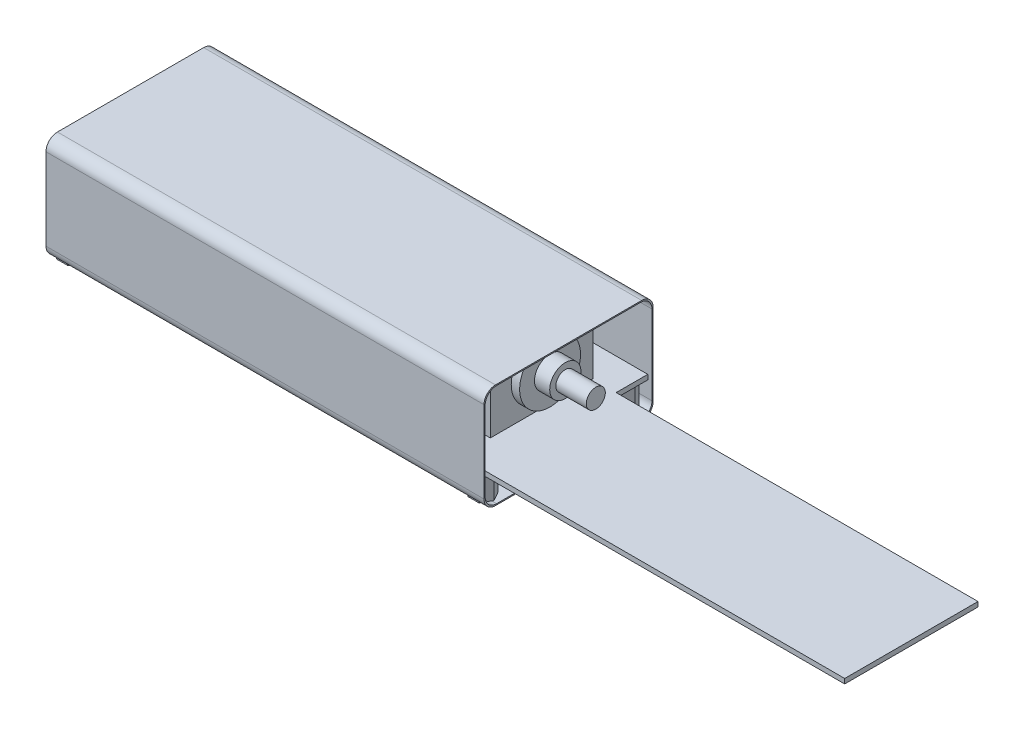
from build123d import *

# Parameters (mm, degrees)
SKETCH1_W            = 145.034
SKETCH1_H            = 54.991
BASE_EXTRUDE_DEPTH   = 1.6002
SKETCH2_W            = 87.884
SKETCH2_H            = 54.991
BOSS_EXTRUDE1_DEPTH  = 12.7
CONN_COMM_DEPTH      = 2.54
CONN_COMM_DEPTH_BACK = 6.35
SKETCH16_W           = 20.32
SKETCH16_H           = 9.144
SKETCH17_W           = 5.08
SKETCH17_H           = 10.16
CONN_PINS_DEPTH      = 16.51
SKETCH17_W_2         = 7.62
SKETCH17_H_2         = 2.54
CONN_PINS_2_DEPTH    = 16.51
SKETCH14_W           = 20.052826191
SKETCH14_H           = 12.7
COILS_DEPTH          = 9.525
SKETCH3_W            = 12.446
SKETCH3_H            = 34.29
BOSS_EXTRUDE2_DEPTH  = 22.606
SKETCH6_R            = 1.27
HEXSTNDOFF_DEPTH     = 9.525
SHIELD_DEPTH         = 146.05
CUT_EXTRUDE1_START   = -6.35
SKETCH18_R           = 1.27
CUT_EXTRUDE1_DEPTH   = 6.35
SKETCH19_W           = 44.45
SKETCH19_H           = 1.6002
EXTRUDE1_DEPTH       = 120.65


with BuildPart() as part:
    # Sketch1 → Base-Extrude (new body)
    with BuildSketch(Plane(origin=(0, 0, 0), x_dir=(1, 0, 0), z_dir=(0, 1, 0))):
        with Locations((72.517, 27.4955)):
            Rectangle(SKETCH1_W, SKETCH1_H)
    extrude(amount=BASE_EXTRUDE_DEPTH)

    # Sketch2 → Boss-Extrude1 (add)
    with BuildSketch(Plane(origin=(0, 1.6002, 0), x_dir=(-1, 0, 0), z_dir=(0, 1, 0))):
        with Locations((-43.942, -27.4955)):
            Rectangle(SKETCH2_W, SKETCH2_H)
    extrude(amount=BOSS_EXTRUDE1_DEPTH)

    # Sketch16 → Conn Comm (add, two sides: drawn at the far end of the back side and taken through both)
    with BuildSketch(Plane.ZY.offset(-CONN_COMM_DEPTH_BACK)):
        with Locations((-27.4955, 13.462)):
            Rectangle(SKETCH16_W, SKETCH16_H)
    extrude(amount=CONN_COMM_DEPTH + CONN_COMM_DEPTH_BACK)

    # Sketch14 → Coils (add)
    with BuildSketch(Plane.XZ):
        with Locations((67.762988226, -14.403423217)):
            Rectangle(SKETCH14_W, SKETCH14_H)
        with Locations((67.762988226, -38.458362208)):
            Rectangle(SKETCH14_W, SKETCH14_H)
    extrude(amount=COILS_DEPTH)

    # Sketch3 → Boss-Extrude2 (add)
    with BuildSketch(Plane(origin=(0, 1.6002, 0), x_dir=(-1, 0, 0), z_dir=(0, 1, 0))):
        with Locations((-130.937, -27.4955)):
            Rectangle(SKETCH3_W, SKETCH3_H)
    extrude(amount=BOSS_EXTRUDE2_DEPTH)

    # Sketch4 → Boss-Revolve1 (revolve)
    with BuildSketch(Plane(origin=(0, 13.5382, 0), x_dir=(-1, 0, 0), z_dir=(0, 1, 0)), mode=Mode.PRIVATE) as boss_revolve1_sk:
        Polygon((-155.194, -27.4955), (-155.194, -30.6705), (-145.034, -30.6705), (-145.034, -32.7025), (-139.954, -32.7025), (-139.954, -37.6555), (-137.16, -37.6555), (-137.16, -27.4955), align=None)
    revolve(boss_revolve1_sk.sketch.rotate(Axis((137.16, 13.5382, -27.4955), (1, 0, 0)), 180), axis=Axis((137.16, 13.5382, -27.4955), (1, 0, 0)))

    # Sketch5 → Boss-Revolve2 (revolve)
    with BuildSketch(Plane(origin=(0, 13.5382, 0), x_dir=(-1, 0, 0), z_dir=(0, 1, 0))):
        Polygon((-124.714, -27.4955), (-124.714, -36.3855), (-122.936, -36.3855), (-122.936, -38.6715), (-105.918, -38.6715), (-105.918, -31.9405), (-96.393, -31.9405), (-96.393, -27.4955), align=None)
    revolve(axis=Axis((124.714, 13.5382, -27.4955), (-1, 0, 0)))

    # Sketch6 → HexStndOff (add)
    # profile 1 of 4: a face of its own
    with BuildSketch(Plane.XZ):
        Polygon((139.263912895, -7.1755), (142.930087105, -7.1755), (144.763174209, -4.0005), (142.930087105, -0.8255), (139.263912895, -0.8255), (137.430825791, -4.0005), align=None)
        with Locations(Location((141.097, -4.0005, 0), (0, 0, 90))):
            Circle(SKETCH6_R, mode=Mode.SUBTRACT)
    # profile 2 of 4: a face of its own
    with BuildSketch(Plane.XZ):
        Polygon((137.430825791, -50.9905), (139.263912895, -54.1655), (142.930087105, -54.1655), (144.763174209, -50.9905), (142.930087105, -47.8155), (139.263912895, -47.8155), align=None)
        with Locations(Location((141.097, -50.9905, 0), (0, 0, 90))):
            Circle(SKETCH6_R, mode=Mode.SUBTRACT)
    # profile 3 of 4: a face of its own
    with BuildSketch(Plane.XZ):
        Polygon((2.103912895, -7.1755), (5.770087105, -7.1755), (7.603174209, -4.0005), (5.770087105, -0.8255), (2.103912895, -0.8255), (0.270825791, -4.0005), align=None)
        with Locations(Location((3.937, -4.0005, 0), (0, 0, 90))):
            Circle(SKETCH6_R, mode=Mode.SUBTRACT)
    # profile 4 of 4: a face of its own
    with BuildSketch(Plane.XZ):
        Polygon((0.270825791, -50.9905), (2.103912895, -54.1655), (5.770087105, -54.1655), (7.603174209, -50.9905), (5.770087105, -47.8155), (2.103912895, -47.8155), align=None)
        with Locations(Location((3.937, -50.9905, 0), (0, 0, 90))):
            Circle(SKETCH6_R, mode=Mode.SUBTRACT)
    extrude(amount=HEXSTNDOFF_DEPTH)



with BuildPart() as body_2:
    # Sketch17 → Conn Pins (new body)
    with BuildSketch(Plane(origin=(0, 1.6002, 0), x_dir=(-1, 0, 0), z_dir=(0, 1, 0))):
        with Locations((-5.08, -47.371)):
            Rectangle(SKETCH17_W, SKETCH17_H)
    extrude(amount=CONN_PINS_DEPTH)


with BuildPart() as body_3:
    # Sketch17 → Conn Pins 2 (new body)
    with BuildSketch(Plane(origin=(0, 1.6002, 0), x_dir=(-1, 0, 0), z_dir=(0, 1, 0))):
        with Locations((-36.83, -6.35)):
            Rectangle(SKETCH17_W_2, SKETCH17_H_2)
    extrude(amount=CONN_PINS_2_DEPTH)


with BuildPart() as part_1:
    add(part.part)

    add(body_3.part)  # Shield merges body 3

    add(body_2.part)  # Shield merges body 2
    # Sketch7 → Shield (add)
    with BuildSketch(Plane(origin=(0, 0, 0), x_dir=(0, 0, -1), z_dir=(1, 0, 0))):
        with BuildLine():
            Line((3.175, 24.9682), (51.943, 24.9682))
            ThreePointArc((51.943, 24.9682), (54.637076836, 23.852276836), (55.753, 21.1582))
            Line((55.753, 21.1582), (55.753, -6.096))
            ThreePointArc((55.753, -6.096), (54.637076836, -8.790076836), (51.943, -9.906))
            Line((51.943, -9.906), (3.175, -9.906))
            ThreePointArc((3.175, -9.906), (0.480923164, -8.790076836), (-0.635, -6.096))
            Line((-0.635, -6.096), (-0.635, 21.1582))
            ThreePointArc((-0.635, 21.1582), (0.480923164, 23.852276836), (3.175, 24.9682))
        make_face()
        with BuildLine():
            Line((3.556, 24.5872), (51.562, 24.5872))
            ThreePointArc((51.562, 24.5872), (54.256076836, 23.471276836), (55.372, 20.7772))
            Line((55.372, 20.7772), (55.372, -5.715))
            ThreePointArc((55.372, -5.715), (54.256076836, -8.409076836), (51.562, -9.525))
            Line((51.562, -9.525), (3.556, -9.525))
            ThreePointArc((3.556, -9.525), (0.861923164, -8.409076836), (-0.254, -5.715))
            Line((-0.254, -5.715), (-0.254, 20.7772))
            ThreePointArc((-0.254, 20.7772), (0.861923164, 23.471276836), (3.556, 24.5872))
        make_face(mode=Mode.SUBTRACT)
    extrude(amount=SHIELD_DEPTH)

    # Sketch18 → Cut-Extrude1 (cut)
    with BuildSketch(Plane.XZ.offset(9.906).offset(CUT_EXTRUDE1_START)):
        with Locations(Location((3.937, -50.9905, 0), (0, 0, 311.409622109))):
            Circle(SKETCH18_R)
        with Locations(Location((141.097, -50.9905, 0), (0, 0, 228.590377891))):
            Circle(SKETCH18_R)
        with Locations(Location((141.097, -4.0005, 0), (0, 0, 40.541601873))):
            Circle(SKETCH18_R)
        with Locations(Location((3.937, -4.0005, 0), (0, 0, 40.541601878))):
            Circle(SKETCH18_R)
    extrude(amount=CUT_EXTRUDE1_DEPTH, mode=Mode.SUBTRACT)

    # Sketch19 → Extrude1 (add)
    with BuildSketch(Plane(origin=(145.034, 0, 0), x_dir=(0, 0, -1), z_dir=(1, 0, 0))):
        with Locations((22.225, 0.8001)):
            Rectangle(SKETCH19_W, SKETCH19_H)
    extrude(amount=EXTRUDE1_DEPTH)


solid = part_1.part
